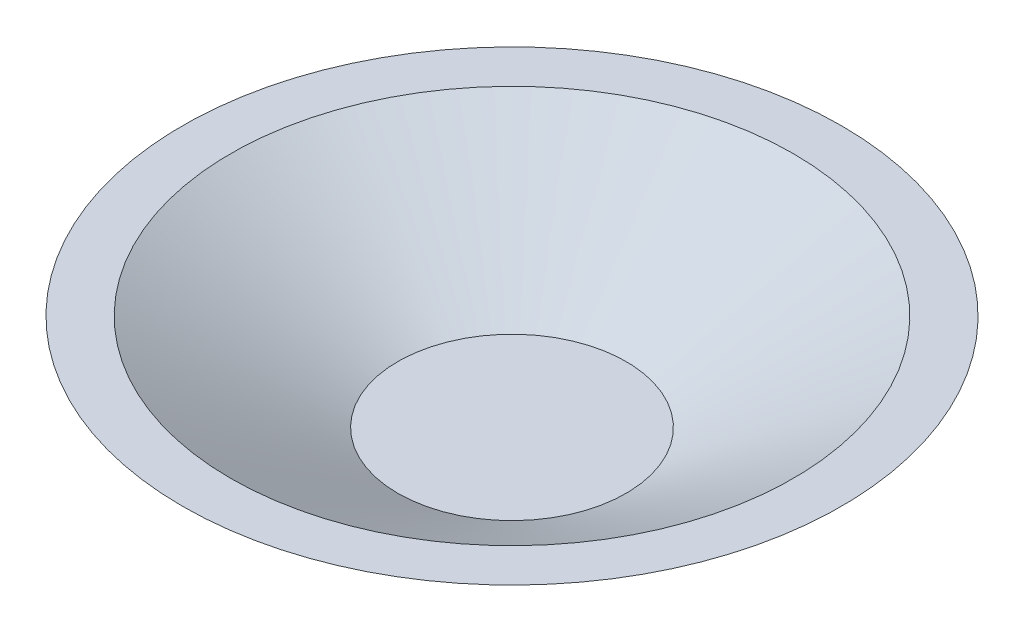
from build123d import *

# Parameters (mm, degrees)
COQUE1_T = -1


with BuildPart() as part:
    # Esquisse1 → Base-R_volution (revolve)
    with BuildSketch(Plane.XY, mode=Mode.PRIVATE) as base_r_volution_sk:
        Polygon((0, 0), (-5, 0), (-13.660254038, 5), (0, 5), align=None)
    revolve(base_r_volution_sk.sketch.rotate(Axis((0, 0, 0), (0, 1, 0)), 270), axis=Axis((0, 0, 0), (0, 1, 0)))

    # Coque1
    coque1_openings = [part.faces().sort_by_distance(p)[0] for p in [
        (0, 5, 0),
    ]]
    offset(amount=COQUE1_T, openings=coque1_openings, kind=Kind.INTERSECTION)


solid = part.part
